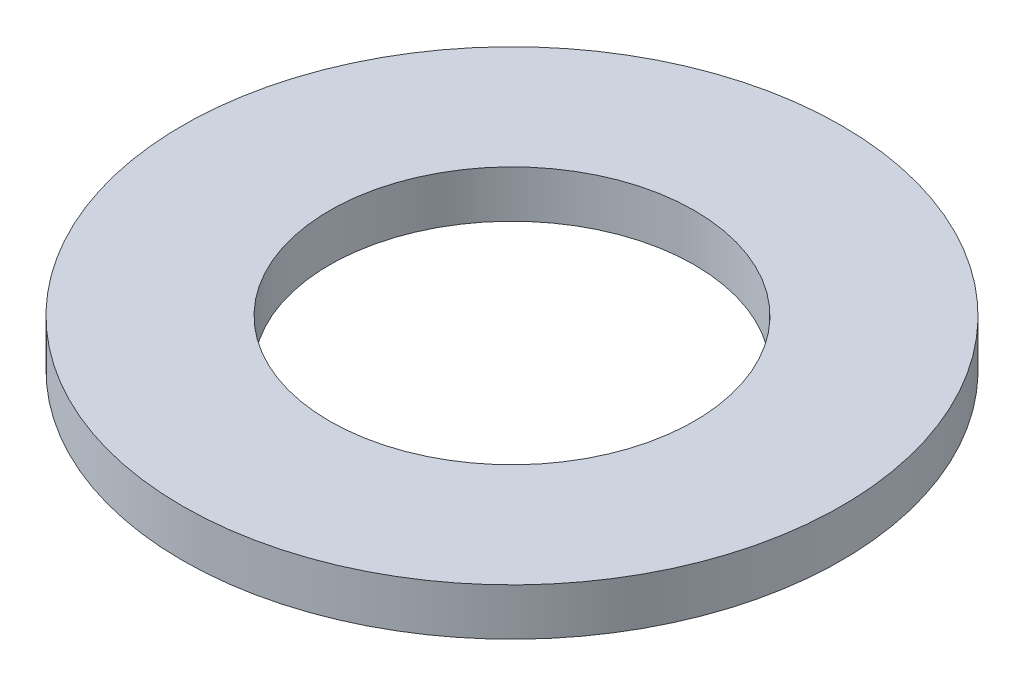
from build123d import *

# Parameters (mm, degrees)
SKETCH1_R      = 28
SKETCH1_R_2    = 15.5
EXTRUDE1_DEPTH = 4


with BuildPart() as part:
    # Sketch1 → Extrude1 (new body)
    with BuildSketch(Plane(origin=(0, 0, 0), x_dir=(1, 0, 0), z_dir=(0, 1, 0))):
        with Locations(Location((0, 0, 0), (0, 0, 270))):
            Circle(SKETCH1_R)
        with Locations(Location((0, 0, 0), (0, 0, 270))):
            Circle(SKETCH1_R_2, mode=Mode.SUBTRACT)
    extrude(amount=EXTRUDE1_DEPTH)


solid = part.part
